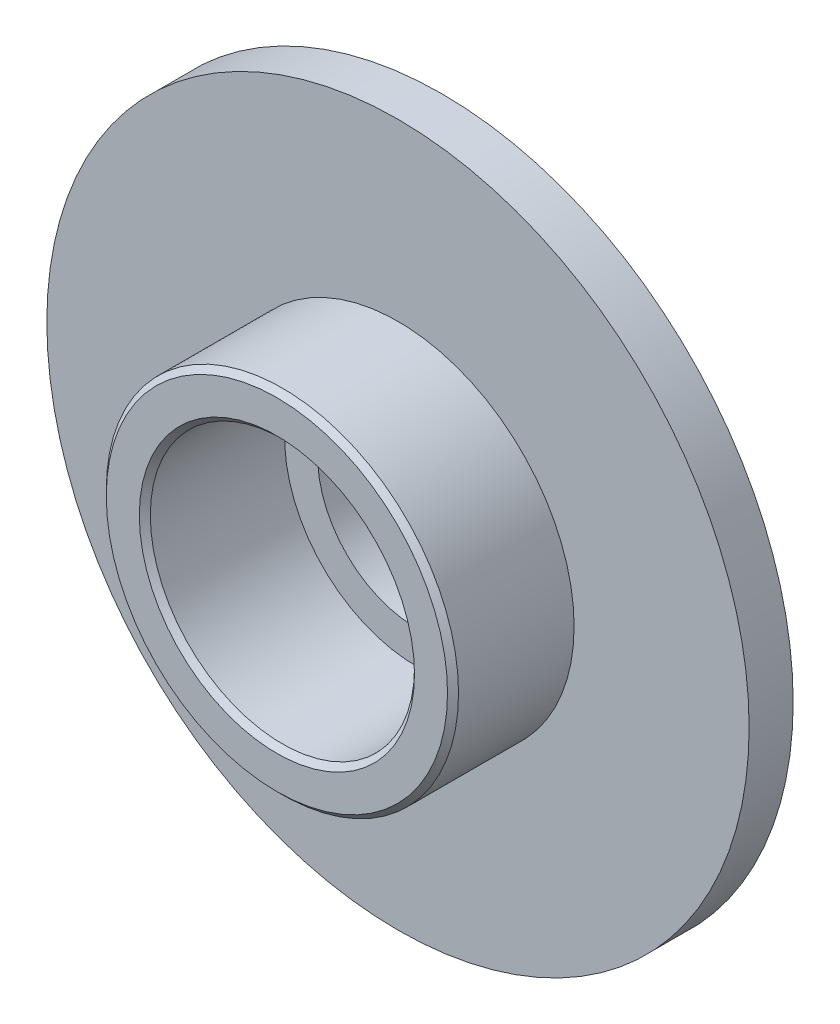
ISO-10303-21;
HEADER;
FILE_DESCRIPTION(('STEP AP214'),'2;1');
FILE_NAME('part.step','',(''),(''),'','','');
FILE_SCHEMA(('AUTOMOTIVE_DESIGN { 1 0 10303 214 1 1 1 1 }'));
ENDSEC;
DATA;
#1=APPLICATION_CONTEXT('core data for automotive mechanical design processes');
#2=APPLICATION_PROTOCOL_DEFINITION('international standard','automotive_design',2000,#1);
#3=PRODUCT_CONTEXT('',#1,'mechanical');
#4=PRODUCT('Part','Part','',(#3));
#5=PRODUCT_RELATED_PRODUCT_CATEGORY('part','',(#4));
#6=PRODUCT_DEFINITION_FORMATION('','',#4);
#7=PRODUCT_DEFINITION_CONTEXT('part definition',#1,'design');
#8=PRODUCT_DEFINITION('design','',#6,#7);
#9=PRODUCT_DEFINITION_SHAPE('','',#8);
#10=(LENGTH_UNIT() NAMED_UNIT(*) SI_UNIT(.MILLI.,.METRE.));
#11=(NAMED_UNIT(*) PLANE_ANGLE_UNIT() SI_UNIT($,.RADIAN.));
#12=(NAMED_UNIT(*) SI_UNIT($,.STERADIAN.) SOLID_ANGLE_UNIT());
#13=UNCERTAINTY_MEASURE_WITH_UNIT(LENGTH_MEASURE(1.E-05),#10,'distance_accuracy_value','');
#14=(GEOMETRIC_REPRESENTATION_CONTEXT(3) GLOBAL_UNCERTAINTY_ASSIGNED_CONTEXT((#13)) GLOBAL_UNIT_ASSIGNED_CONTEXT((#10,
#11,#12)) REPRESENTATION_CONTEXT('',''));
#15=CARTESIAN_POINT('',(0.,0.,0.));
#16=DIRECTION('',(0.,0.,1.));
#17=DIRECTION('',(1.,0.,0.));
#18=AXIS2_PLACEMENT_3D('',#15,#16,#17);
#19=CARTESIAN_POINT('',(0.,13.4,-5.5));
#20=DIRECTION('',(0.,0.,-1.));
#21=DIRECTION('',(-1.,0.,0.));
#22=AXIS2_PLACEMENT_3D('',#19,#20,#21);
#23=PLANE('',#22);
#24=CARTESIAN_POINT('',(0.,0.,-5.5));
#25=DIRECTION('',(0.,0.,1.));
#26=DIRECTION('',(1.,0.,0.));
#27=AXIS2_PLACEMENT_3D('',#24,#25,#26);
#28=CIRCLE('',#27,16.9);
#29=CARTESIAN_POINT('',(-8.80202735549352,14.4268608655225,-5.5));
#30=VERTEX_POINT('',#29);
#31=CARTESIAN_POINT('',(-2.76121314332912,-16.6729032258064,-5.5));
#32=VERTEX_POINT('',#31);
#33=EDGE_CURVE('E645',#30,#32,#28,.T.);
#34=ORIENTED_EDGE('',*,*,#33,.T.);
#35=CARTESIAN_POINT('',(-1.08235984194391E-13,-15.5,-5.5));
#36=DIRECTION('',(0.,0.,-1.));
#37=DIRECTION('',(-1.,0.,0.));
#38=AXIS2_PLACEMENT_3D('',#35,#36,#37);
#39=CIRCLE('',#38,3.);
#40=CARTESIAN_POINT('',(-1.98650596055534,-13.2519354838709,-5.50000000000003));
#41=VERTEX_POINT('',#40);
#42=EDGE_CURVE('E779',#32,#41,#39,.T.);
#43=ORIENTED_EDGE('',*,*,#42,.T.);
#44=CARTESIAN_POINT('',(0.,0.,-5.5));
#45=DIRECTION('',(0.,0.,1.));
#46=DIRECTION('',(1.,0.,0.));
#47=AXIS2_PLACEMENT_3D('',#44,#45,#46);
#48=CIRCLE('',#47,13.4);
#49=CARTESIAN_POINT('',(-2.10404371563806,13.2337825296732,-5.5));
#50=VERTEX_POINT('',#49);
#51=EDGE_CURVE('E641',#50,#41,#48,.T.);
#52=ORIENTED_EDGE('',*,*,#51,.F.);
#53=DIRECTION('',(-0.984503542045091,0.175364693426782,0.));
#54=VECTOR('',#53,1.);
#55=CARTESIAN_POINT('',(-0.0934021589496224,12.8756370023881,-5.5));
#56=LINE('',#55,#54);
#57=EDGE_CURVE('E732',#50,#30,#56,.T.);
#58=ORIENTED_EDGE('',*,*,#57,.T.);
#59=EDGE_LOOP('',(#34,#43,#52,#58));
#60=FACE_BOUND('',#59,.T.);
#61=ADVANCED_FACE('F353',(#60),#23,.F.);
#62=CARTESIAN_POINT('',(0.,0.,-5.));
#63=DIRECTION('',(0.,0.,1.));
#64=DIRECTION('',(1.,0.,0.));
#65=AXIS2_PLACEMENT_3D('',#62,#63,#64);
#66=TOROIDAL_SURFACE('',#65,13.4,0.5);
#67=ORIENTED_EDGE('',*,*,#51,.T.);
#68=CARTESIAN_POINT('',(-2.14262454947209,-13.4002,-5.47006198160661));
#69=CARTESIAN_POINT('',(-2.11391163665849,-13.3708529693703,-5.48218078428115));
#70=CARTESIAN_POINT('',(-2.08387957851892,-13.341458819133,-5.49039063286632));
#71=CARTESIAN_POINT('',(-2.02225090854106,-13.283647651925,-5.49977922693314));
#72=CARTESIAN_POINT('',(-1.99066828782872,-13.2552248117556,-5.50101218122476));
#73=CARTESIAN_POINT('',(-1.91969316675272,-13.194043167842,-5.49701045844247));
#74=CARTESIAN_POINT('',(-1.88007297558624,-13.1616543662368,-5.49033860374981));
#75=CARTESIAN_POINT('',(-1.80038846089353,-13.0997589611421,-5.4690941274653));
#76=CARTESIAN_POINT('',(-1.76032289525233,-13.0702687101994,-5.45447941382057));
#77=CARTESIAN_POINT('',(-1.68071326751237,-13.014523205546,-5.41768065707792));
#78=CARTESIAN_POINT('',(-1.64117959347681,-12.9883065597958,-5.39541613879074));
#79=CARTESIAN_POINT('',(-1.56485775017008,-12.940073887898,-5.34317044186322));
#80=CARTESIAN_POINT('',(-1.52805603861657,-12.9180361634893,-5.31323113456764));
#81=CARTESIAN_POINT('',(-1.47965975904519,-12.8902294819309,-5.26379116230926));
#82=CARTESIAN_POINT('',(-1.46556425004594,-12.8823000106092,-5.24794013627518));
#83=CARTESIAN_POINT('',(-1.43908802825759,-12.8676528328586,-5.21432957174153));
#84=CARTESIAN_POINT('',(-1.426706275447,-12.8609343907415,-5.1965712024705));
#85=CARTESIAN_POINT('',(-1.40612775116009,-12.8499206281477,-5.16187764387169));
#86=CARTESIAN_POINT('',(-1.3975815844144,-12.8454127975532,-5.14522085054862));
#87=CARTESIAN_POINT('',(-1.3829723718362,-12.8377723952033,-5.1105520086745));
#88=CARTESIAN_POINT('',(-1.376904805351,-12.83463731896,-5.092542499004));
#89=CARTESIAN_POINT('',(-1.36874552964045,-12.8304395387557,-5.0588718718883));
#90=CARTESIAN_POINT('',(-1.36613449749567,-12.8291052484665,-5.04337214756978));
#91=CARTESIAN_POINT('',(-1.36330580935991,-12.8276601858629,-5.01210094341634));
#92=CARTESIAN_POINT('',(-1.36308657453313,-12.8275486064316,-4.99632964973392));
#93=CARTESIAN_POINT('',(-1.36506333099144,-12.8285578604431,-4.96499763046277));
#94=CARTESIAN_POINT('',(-1.36725725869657,-12.8296776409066,-4.94943673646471));
#95=CARTESIAN_POINT('',(-1.37382633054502,-12.8330514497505,-4.91891107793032));
#96=CARTESIAN_POINT('',(-1.3782035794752,-12.8353065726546,-4.90394690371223));
#97=CARTESIAN_POINT('',(-1.39085160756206,-12.8418804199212,-4.86915326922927));
#98=CARTESIAN_POINT('',(-1.39997657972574,-12.8466619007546,-4.84972443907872));
#99=CARTESIAN_POINT('',(-1.4207436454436,-12.8577231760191,-4.81273082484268));
#100=CARTESIAN_POINT('',(-1.43239212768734,-12.8640067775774,-4.79517094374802));
#101=CARTESIAN_POINT('',(-1.46495428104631,-12.8819040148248,-4.75181590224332));
#102=CARTESIAN_POINT('',(-1.48722241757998,-12.8944483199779,-4.72743154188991));
#103=CARTESIAN_POINT('',(-1.53422520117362,-12.9218412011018,-4.68270367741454));
#104=CARTESIAN_POINT('',(-1.55896552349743,-12.9366951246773,-4.66236980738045));
#105=CARTESIAN_POINT('',(-1.62214093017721,-12.975990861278,-4.61637371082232));
#106=CARTESIAN_POINT('',(-1.66142732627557,-13.0016022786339,-4.59286978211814));
#107=CARTESIAN_POINT('',(-1.74120469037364,-13.0565260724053,-4.55336324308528));
#108=CARTESIAN_POINT('',(-1.78169742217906,-13.0858440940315,-4.53737225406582));
#109=CARTESIAN_POINT('',(-1.86313932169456,-13.1481129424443,-4.51322248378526));
#110=CARTESIAN_POINT('',(-1.90408762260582,-13.1811058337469,-4.50516762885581));
#111=CARTESIAN_POINT('',(-1.98451253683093,-13.2495628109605,-4.49843505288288));
#112=CARTESIAN_POINT('',(-2.02399525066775,-13.2850143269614,-4.49971268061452));
#113=CARTESIAN_POINT('',(-2.07586705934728,-13.3340943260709,-4.50881303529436));
#114=CARTESIAN_POINT('',(-2.08954989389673,-13.347295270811,-4.51196789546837));
#115=CARTESIAN_POINT('',(-2.11645522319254,-13.3737421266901,-4.51979494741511));
#116=CARTESIAN_POINT('',(-2.12967725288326,-13.3869880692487,-4.52446862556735));
#117=CARTESIAN_POINT('',(-2.14262454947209,-13.4002,-4.52993801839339));
#118=B_SPLINE_CURVE_WITH_KNOTS('',3,(#68,#69,#70,#71,#72,#73,#74,#75,#76,#77,#78,#79,#80,#81,
#82,#83,#84,#85,#86,#87,#88,#89,#90,#91,#92,#93,#94,#95,#96,#97,#98,#99,#100,#101,#102,#103,
#104,#105,#106,#107,#108,#109,#110,#111,#112,#113,#114,#115,#116,#117),.UNSPECIFIED.,.F.,.F.,(4,
2,2,2,2,2,2,2,2,2,2,2,2,2,2,2,2,2,2,2,2,2,2,2,4),(0.,0.127950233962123,0.254904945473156,
0.40896698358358,0.563853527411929,0.720422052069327,0.876153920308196,0.943963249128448,
1.01173124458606,1.06929936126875,1.12676200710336,1.17387310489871,1.22095310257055,
1.26799287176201,1.31507807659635,1.38067790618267,1.4464457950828,1.55182972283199,
1.65746138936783,1.81402616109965,1.97083232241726,2.12966565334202,2.287739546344,
2.345503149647,2.4033234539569),.UNSPECIFIED.);
#119=CARTESIAN_POINT('',(-1.98650596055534,-13.251935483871,-4.5));
#120=VERTEX_POINT('',#119);
#121=EDGE_CURVE('E777',#41,#120,#118,.T.);
#122=ORIENTED_EDGE('',*,*,#121,.T.);
#123=CARTESIAN_POINT('',(0.,0.,-4.5));
#124=DIRECTION('',(0.,0.,1.));
#125=DIRECTION('',(1.,0.,0.));
#126=AXIS2_PLACEMENT_3D('',#123,#124,#125);
#127=CIRCLE('',#126,13.4);
#128=CARTESIAN_POINT('',(-2.10404371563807,13.2337825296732,-4.5));
#129=VERTEX_POINT('',#128);
#130=EDGE_CURVE('E637',#129,#120,#127,.T.);
#131=ORIENTED_EDGE('',*,*,#130,.F.);
#132=CARTESIAN_POINT('',(-3.03831723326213,13.4002,-4.63370240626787));
#133=CARTESIAN_POINT('',(-3.00948138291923,13.3950636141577,-4.62314269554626));
#134=CARTESIAN_POINT('',(-2.98033948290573,13.3898727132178,-4.61349423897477));
#135=CARTESIAN_POINT('',(-2.92161312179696,13.3794120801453,-4.59578789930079));
#136=CARTESIAN_POINT('',(-2.89202902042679,13.3741424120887,-4.58772879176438));
#137=CARTESIAN_POINT('',(-2.83261577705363,13.3635594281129,-4.57297176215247));
#138=CARTESIAN_POINT('',(-2.80278741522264,13.3582462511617,-4.56627054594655));
#139=CARTESIAN_POINT('',(-2.74289387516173,13.3475777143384,-4.55404062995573));
#140=CARTESIAN_POINT('',(-2.71282864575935,13.3422223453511,-4.54851219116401));
#141=CARTESIAN_POINT('',(-2.62295010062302,13.3262127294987,-4.53357633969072));
#142=CARTESIAN_POINT('',(-2.5628909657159,13.3155146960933,-4.525684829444));
#143=CARTESIAN_POINT('',(-2.44241816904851,13.2940554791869,-4.51322421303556));
#144=CARTESIAN_POINT('',(-2.38200431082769,13.2832942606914,-4.50865716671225));
#145=CARTESIAN_POINT('',(-2.28892919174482,13.2667152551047,-4.50381349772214));
#146=CARTESIAN_POINT('',(-2.25631486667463,13.2609058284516,-4.50252957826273));
#147=CARTESIAN_POINT('',(-2.19107697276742,13.2492853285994,-4.50072821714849));
#148=CARTESIAN_POINT('',(-2.1584534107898,13.2434742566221,-4.5002105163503));
#149=CARTESIAN_POINT('',(-2.06024255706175,13.2259804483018,-4.4997358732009));
#150=CARTESIAN_POINT('',(-1.99464762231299,13.2142963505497,-4.50087371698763));
#151=CARTESIAN_POINT('',(-1.92910442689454,13.2026214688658,-4.503281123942));
#152=B_SPLINE_CURVE_WITH_KNOTS('',3,(#132,#133,#134,#135,#136,#137,#138,#139,#140,#141,#142,
#143,#144,#145,#146,#147,#148,#149,#150,#151),.UNSPECIFIED.,.F.,.F.,(4,2,2,2,2,2,2,2,2,4),(0.,
0.0933664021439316,0.186660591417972,0.279725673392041,0.372811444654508,0.557225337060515,
0.741753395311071,0.841202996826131,0.940618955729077,1.14046443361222),.UNSPECIFIED.);
#153=CARTESIAN_POINT('',(-1.9293044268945,13.2026570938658,-4.50327374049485));
#154=VERTEX_POINT('',#153);
#155=EDGE_CURVE('E719',#129,#154,#152,.T.);
#156=ORIENTED_EDGE('',*,*,#155,.T.);
#157=CARTESIAN_POINT('',(-1.9295044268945,13.2028250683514,-4.50325133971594));
#158=CARTESIAN_POINT('',(-1.90954511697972,13.1860587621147,-4.50548914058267));
#159=CARTESIAN_POINT('',(-1.88945634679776,13.1696310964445,-4.50883491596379));
#160=CARTESIAN_POINT('',(-1.8491473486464,13.1375187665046,-4.51762700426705));
#161=CARTESIAN_POINT('',(-1.82892713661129,13.121834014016,-4.52307306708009));
#162=CARTESIAN_POINT('',(-1.76792756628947,13.0757406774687,-4.54249352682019));
#163=CARTESIAN_POINT('',(-1.72713471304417,13.0465651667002,-4.5595107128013));
#164=CARTESIAN_POINT('',(-1.65349638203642,12.9964809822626,-4.59781072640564));
#165=CARTESIAN_POINT('',(-1.62043519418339,12.9749990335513,-4.61795370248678));
#166=CARTESIAN_POINT('',(-1.55650284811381,12.9351026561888,-4.66386550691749));
#167=CARTESIAN_POINT('',(-1.5256238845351,12.9166769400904,-4.68961278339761));
#168=CARTESIAN_POINT('',(-1.4814556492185,12.891242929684,-4.73420646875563));
#169=CARTESIAN_POINT('',(-1.4666219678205,12.8828880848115,-4.75075923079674));
#170=CARTESIAN_POINT('',(-1.4388322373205,12.8675085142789,-4.78595417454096));
#171=CARTESIAN_POINT('',(-1.42587427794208,12.8604824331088,-4.80459419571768));
#172=CARTESIAN_POINT('',(-1.40510257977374,12.8493780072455,-4.84006395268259));
#173=CARTESIAN_POINT('',(-1.39677854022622,12.8449908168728,-4.85649346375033));
#174=CARTESIAN_POINT('',(-1.38254998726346,12.8375536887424,-4.89065749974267));
#175=CARTESIAN_POINT('',(-1.37664133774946,12.8345014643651,-4.90838973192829));
#176=CARTESIAN_POINT('',(-1.36862339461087,12.830376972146,-4.94176634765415));
#177=CARTESIAN_POINT('',(-1.36604498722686,12.8290594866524,-4.95726610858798));
#178=CARTESIAN_POINT('',(-1.36328164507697,12.8276478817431,-4.98853109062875));
#179=CARTESIAN_POINT('',(-1.36309516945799,12.8275529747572,-5.00429613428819));
#180=CARTESIAN_POINT('',(-1.36513369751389,12.8285938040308,-5.03560844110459));
#181=CARTESIAN_POINT('',(-1.36735644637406,12.8297283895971,-5.05115589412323));
#182=CARTESIAN_POINT('',(-1.37397689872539,12.8331289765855,-5.08165128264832));
#183=CARTESIAN_POINT('',(-1.37837673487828,12.8353960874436,-5.09659861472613));
#184=CARTESIAN_POINT('',(-1.39109048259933,12.8420052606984,-5.13140408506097));
#185=CARTESIAN_POINT('',(-1.40026478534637,12.8468137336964,-5.15085668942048));
#186=CARTESIAN_POINT('',(-1.42113036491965,12.857930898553,-5.18788767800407));
#187=CARTESIAN_POINT('',(-1.43282779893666,12.8642432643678,-5.20546131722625));
#188=CARTESIAN_POINT('',(-1.46552221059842,12.8822210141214,-5.24885352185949));
#189=CARTESIAN_POINT('',(-1.48787405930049,12.8948192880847,-5.27325529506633));
#190=CARTESIAN_POINT('',(-1.53505580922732,12.922334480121,-5.31801792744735));
#191=CARTESIAN_POINT('',(-1.55989277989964,12.9372580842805,-5.33836673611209));
#192=CARTESIAN_POINT('',(-1.62328072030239,12.9767208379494,-5.3843616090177));
#193=CARTESIAN_POINT('',(-1.66267817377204,13.0024306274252,-5.40784262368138));
#194=CARTESIAN_POINT('',(-1.74257067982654,13.0575005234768,-5.44721758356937));
#195=CARTESIAN_POINT('',(-1.78306412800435,13.0868554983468,-5.46312204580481));
#196=CARTESIAN_POINT('',(-1.84125575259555,13.1313967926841,-5.4802471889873));
#197=CARTESIAN_POINT('',(-1.85901729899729,13.1453091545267,-5.48470269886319));
#198=CARTESIAN_POINT('',(-1.89438793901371,13.1736707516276,-5.49197146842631));
#199=CARTESIAN_POINT('',(-1.91199726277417,13.1881188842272,-5.49478792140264));
#200=CARTESIAN_POINT('',(-1.9295044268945,13.2028250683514,-5.49674866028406));
#201=B_SPLINE_CURVE_WITH_KNOTS('',3,(#157,#158,#159,#160,#161,#162,#163,#164,#165,#166,#167,
#168,#169,#170,#171,#172,#173,#174,#175,#176,#177,#178,#179,#180,#181,#182,#183,#184,#185,#186,
#187,#188,#189,#190,#191,#192,#193,#194,#195,#196,#197,#198,#199,#200),.UNSPECIFIED.,.F.,.F.,(4,
2,2,2,2,2,2,2,2,2,2,2,2,2,2,2,2,2,2,2,2,4),(0.,0.0784204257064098,0.15683151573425,
0.314916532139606,0.447355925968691,0.579294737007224,0.650385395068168,0.721403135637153,
0.778009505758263,0.834518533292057,0.88160886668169,0.928668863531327,0.975684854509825,
1.02274699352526,1.08848799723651,1.15439128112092,1.26002686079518,1.36597198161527,
1.52291459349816,1.6796387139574,1.74857484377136,1.81737621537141),.UNSPECIFIED.);
#202=CARTESIAN_POINT('',(-1.9293044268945,13.2026570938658,-5.49672625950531));
#203=VERTEX_POINT('',#202);
#204=EDGE_CURVE('E610',#154,#203,#201,.T.);
#205=ORIENTED_EDGE('',*,*,#204,.T.);
#206=CARTESIAN_POINT('',(-1.92910442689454,13.2026214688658,-5.496718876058));
#207=CARTESIAN_POINT('',(-1.9708567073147,13.2100585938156,-5.4982585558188));
#208=CARTESIAN_POINT('',(-2.01262739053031,13.2174989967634,-5.49927621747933));
#209=CARTESIAN_POINT('',(-2.09619132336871,13.2323838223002,-5.50018307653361));
#210=CARTESIAN_POINT('',(-2.13798457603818,13.239828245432,-5.50007197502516));
#211=CARTESIAN_POINT('',(-2.26386966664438,13.2622515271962,-5.4979089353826));
#212=CARTESIAN_POINT('',(-2.3479404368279,13.2772266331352,-5.49400564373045));
#213=CARTESIAN_POINT('',(-2.51383016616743,13.3067757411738,-5.48037303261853));
#214=CARTESIAN_POINT('',(-2.59565835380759,13.3213513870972,-5.47077218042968));
#215=CARTESIAN_POINT('',(-2.71741519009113,13.3430393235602,-5.45080871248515));
#216=CARTESIAN_POINT('',(-2.75778983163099,13.3502310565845,-5.44323930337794));
#217=CARTESIAN_POINT('',(-2.83807612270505,13.364532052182,-5.42591171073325));
#218=CARTESIAN_POINT('',(-2.87798796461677,13.3716413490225,-5.41615447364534));
#219=CARTESIAN_POINT('',(-2.93787023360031,13.3823078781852,-5.39938017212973));
#220=CARTESIAN_POINT('',(-2.95810562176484,13.385912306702,-5.39333584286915));
#221=CARTESIAN_POINT('',(-2.99838383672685,13.3930868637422,-5.38044204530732));
#222=CARTESIAN_POINT('',(-3.01842602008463,13.3966568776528,-5.37359050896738));
#223=CARTESIAN_POINT('',(-3.03831723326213,13.4002,-5.36629759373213));
#224=B_SPLINE_CURVE_WITH_KNOTS('',3,(#206,#207,#208,#209,#210,#211,#212,#213,#214,#215,#216,
#217,#218,#219,#220,#221,#222,#223),.UNSPECIFIED.,.F.,.F.,(4,2,2,2,2,2,2,2,4),(0.,
0.127307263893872,0.254648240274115,0.510933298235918,0.761648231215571,0.88671297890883,
1.01172372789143,1.07598224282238,1.1404091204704),.UNSPECIFIED.);
#225=EDGE_CURVE('E726',#203,#50,#224,.T.);
#226=ORIENTED_EDGE('',*,*,#225,.T.);
#227=EDGE_LOOP('',(#67,#122,#131,#156,#205,#226));
#228=FACE_BOUND('',#227,.T.);
#229=ADVANCED_FACE('F669',(#228),#66,.F.);
#230=CARTESIAN_POINT('',(0.,16.9,-4.5));
#231=DIRECTION('',(0.,0.,1.));
#232=DIRECTION('',(1.,0.,0.));
#233=AXIS2_PLACEMENT_3D('',#230,#231,#232);
#234=PLANE('',#233);
#235=ORIENTED_EDGE('',*,*,#130,.T.);
#236=CARTESIAN_POINT('',(-1.08235984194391E-13,-15.5,-4.5));
#237=DIRECTION('',(0.,0.,1.));
#238=DIRECTION('',(1.,0.,0.));
#239=AXIS2_PLACEMENT_3D('',#236,#237,#238);
#240=CIRCLE('',#239,3.);
#241=CARTESIAN_POINT('',(-2.76121314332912,-16.6729032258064,-4.5));
#242=VERTEX_POINT('',#241);
#243=EDGE_CURVE('E776',#120,#242,#240,.T.);
#244=ORIENTED_EDGE('',*,*,#243,.T.);
#245=CARTESIAN_POINT('',(0.,0.,-4.5));
#246=DIRECTION('',(0.,0.,1.));
#247=DIRECTION('',(1.,0.,0.));
#248=AXIS2_PLACEMENT_3D('',#245,#246,#247);
#249=CIRCLE('',#248,16.9);
#250=CARTESIAN_POINT('',(-8.80202735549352,14.4268608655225,-4.5));
#251=VERTEX_POINT('',#250);
#252=EDGE_CURVE('E510',#251,#242,#249,.T.);
#253=ORIENTED_EDGE('',*,*,#252,.F.);
#254=DIRECTION('',(0.984503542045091,-0.175364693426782,0.));
#255=VECTOR('',#254,1.);
#256=CARTESIAN_POINT('',(-0.697667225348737,12.9832717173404,-4.5));
#257=LINE('',#256,#255);
#258=EDGE_CURVE('E716',#251,#129,#257,.T.);
#259=ORIENTED_EDGE('',*,*,#258,.T.);
#260=EDGE_LOOP('',(#235,#244,#253,#259));
#261=FACE_BOUND('',#260,.T.);
#262=ADVANCED_FACE('F545',(#261),#234,.F.);
#263=CARTESIAN_POINT('',(0.,0.,13.7955271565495));
#264=DIRECTION('',(0.,0.,1.));
#265=DIRECTION('',(1.,0.,0.));
#266=AXIS2_PLACEMENT_3D('',#263,#264,#265);
#267=CYLINDRICAL_SURFACE('',#266,12.);
#268=CARTESIAN_POINT('',(0.,0.,14.5));
#269=DIRECTION('',(0.,0.,-1.));
#270=DIRECTION('',(-1.,0.,0.));
#271=AXIS2_PLACEMENT_3D('',#268,#269,#270);
#272=CIRCLE('',#271,12.);
#273=CARTESIAN_POINT('',(-12.,0.,14.5));
#274=VERTEX_POINT('',#273);
#275=EDGE_CURVE('E523',#274,#274,#272,.F.);
#276=ORIENTED_EDGE('',*,*,#275,.T.);
#277=EDGE_LOOP('',(#276));
#278=FACE_BOUND('',#277,.T.);
#279=CARTESIAN_POINT('',(0.,0.,2.3));
#280=DIRECTION('',(0.,0.,1.));
#281=DIRECTION('',(1.,0.,0.));
#282=AXIS2_PLACEMENT_3D('',#279,#280,#281);
#283=CIRCLE('',#282,12.);
#284=CARTESIAN_POINT('',(12.,0.,2.3));
#285=VERTEX_POINT('',#284);
#286=EDGE_CURVE('E548',#285,#285,#283,.T.);
#287=ORIENTED_EDGE('',*,*,#286,.F.);
#288=EDGE_LOOP('',(#287));
#289=FACE_BOUND('',#288,.T.);
#290=ADVANCED_FACE('F355',(#278,#289),#267,.F.);
#291=CARTESIAN_POINT('',(0.,9.,2.3));
#292=DIRECTION('',(0.,0.,-1.));
#293=DIRECTION('',(-1.,0.,0.));
#294=AXIS2_PLACEMENT_3D('',#291,#292,#293);
#295=PLANE('',#294);
#296=CARTESIAN_POINT('',(0.,0.,2.3));
#297=DIRECTION('',(0.,0.,1.));
#298=DIRECTION('',(1.,0.,0.));
#299=AXIS2_PLACEMENT_3D('',#296,#297,#298);
#300=CIRCLE('',#299,9.);
#301=CARTESIAN_POINT('',(9.,0.,2.3));
#302=VERTEX_POINT('',#301);
#303=EDGE_CURVE('E551',#302,#302,#300,.T.);
#304=ORIENTED_EDGE('',*,*,#303,.F.);
#305=EDGE_LOOP('',(#304));
#306=FACE_BOUND('',#305,.T.);
#307=ORIENTED_EDGE('',*,*,#286,.T.);
#308=EDGE_LOOP('',(#307));
#309=FACE_BOUND('',#308,.T.);
#310=ADVANCED_FACE('F544',(#306,#309),#295,.F.);
#311=CARTESIAN_POINT('',(0.,0.,13.7955271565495));
#312=DIRECTION('',(0.,0.,1.));
#313=DIRECTION('',(1.,0.,0.));
#314=AXIS2_PLACEMENT_3D('',#311,#312,#313);
#315=CYLINDRICAL_SURFACE('',#314,9.);
#316=CARTESIAN_POINT('',(0.,0.,-7.7));
#317=DIRECTION('',(0.,0.,1.));
#318=DIRECTION('',(1.,0.,0.));
#319=AXIS2_PLACEMENT_3D('',#316,#317,#318);
#320=CIRCLE('',#319,9.);
#321=CARTESIAN_POINT('',(9.,0.,-7.7));
#322=VERTEX_POINT('',#321);
#323=EDGE_CURVE('E555',#322,#322,#320,.T.);
#324=ORIENTED_EDGE('',*,*,#323,.F.);
#325=EDGE_LOOP('',(#324));
#326=FACE_BOUND('',#325,.T.);
#327=ORIENTED_EDGE('',*,*,#303,.T.);
#328=EDGE_LOOP('',(#327));
#329=FACE_BOUND('',#328,.T.);
#330=ADVANCED_FACE('F659',(#326,#329),#315,.F.);
#331=CARTESIAN_POINT('',(0.,14.45,-7.7));
#332=DIRECTION('',(0.,0.,1.));
#333=DIRECTION('',(1.,0.,0.));
#334=AXIS2_PLACEMENT_3D('',#331,#332,#333);
#335=PLANE('',#334);
#336=DIRECTION('',(-0.98450354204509,0.175364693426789,0.));
#337=VECTOR('',#336,1.);
#338=CARTESIAN_POINT('',(-4.71482129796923,-12.0191721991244,-7.7));
#339=LINE('',#338,#337);
#340=CARTESIAN_POINT('',(4.63858674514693,-13.6852480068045,-7.7));
#341=VERTEX_POINT('',#340);
#342=CARTESIAN_POINT('',(1.92930442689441,-13.2026570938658,-7.7));
#343=VERTEX_POINT('',#342);
#344=EDGE_CURVE('E749',#341,#343,#339,.T.);
#345=ORIENTED_EDGE('',*,*,#344,.T.);
#346=CARTESIAN_POINT('',(-1.08235984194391E-13,-15.5,-7.7));
#347=DIRECTION('',(0.,0.,1.));
#348=DIRECTION('',(1.,0.,0.));
#349=AXIS2_PLACEMENT_3D('',#346,#347,#348);
#350=CIRCLE('',#349,3.);
#351=CARTESIAN_POINT('',(-2.70140822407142,-14.1952419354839,-7.7));
#352=VERTEX_POINT('',#351);
#353=EDGE_CURVE('E747',#343,#352,#350,.T.);
#354=ORIENTED_EDGE('',*,*,#353,.T.);
#355=CARTESIAN_POINT('',(0.,0.,-7.7));
#356=DIRECTION('',(0.,0.,1.));
#357=DIRECTION('',(1.,0.,0.));
#358=AXIS2_PLACEMENT_3D('',#355,#356,#357);
#359=CIRCLE('',#358,14.45);
#360=CARTESIAN_POINT('',(-4.63858674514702,13.6852480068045,-7.7));
#361=VERTEX_POINT('',#360);
#362=EDGE_CURVE('E652',#361,#352,#359,.T.);
#363=ORIENTED_EDGE('',*,*,#362,.F.);
#364=DIRECTION('',(0.984503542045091,-0.175364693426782,0.));
#365=VECTOR('',#364,1.);
#366=CARTESIAN_POINT('',(-0.274681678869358,12.9079274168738,-7.7));
#367=LINE('',#366,#365);
#368=CARTESIAN_POINT('',(-1.9293044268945,13.2026570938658,-7.7));
#369=VERTEX_POINT('',#368);
#370=EDGE_CURVE('E581',#361,#369,#367,.T.);
#371=ORIENTED_EDGE('',*,*,#370,.T.);
#372=CARTESIAN_POINT('',(0.,15.5,-7.7));
#373=DIRECTION('',(0.,0.,1.));
#374=DIRECTION('',(1.,0.,0.));
#375=AXIS2_PLACEMENT_3D('',#372,#373,#374);
#376=CIRCLE('',#375,3.);
#377=CARTESIAN_POINT('',(2.70140822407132,14.1952419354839,-7.7));
#378=VERTEX_POINT('',#377);
#379=EDGE_CURVE('E619',#369,#378,#376,.T.);
#380=ORIENTED_EDGE('',*,*,#379,.T.);
#381=EDGE_CURVE('E651',#341,#378,#359,.T.);
#382=ORIENTED_EDGE('',*,*,#381,.F.);
#383=EDGE_LOOP('',(#345,#354,#363,#371,#380,#382));
#384=FACE_BOUND('',#383,.T.);
#385=ORIENTED_EDGE('',*,*,#323,.T.);
#386=EDGE_LOOP('',(#385));
#387=FACE_BOUND('',#386,.T.);
#388=ADVANCED_FACE('F657',(#384,#387),#335,.F.);
#389=CARTESIAN_POINT('',(0.,0.,13.7955271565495));
#390=DIRECTION('',(0.,0.,1.));
#391=DIRECTION('',(1.,0.,0.));
#392=AXIS2_PLACEMENT_3D('',#389,#390,#391);
#393=CYLINDRICAL_SURFACE('',#392,14.45);
#394=ORIENTED_EDGE('',*,*,#362,.T.);
#395=DIRECTION('',(0.,0.,1.));
#396=VECTOR('',#395,1.);
#397=CARTESIAN_POINT('',(-2.70140822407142,-14.1952419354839,-5.));
#398=LINE('',#397,#396);
#399=CARTESIAN_POINT('',(-2.70140822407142,-14.1952419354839,-8.4));
#400=VERTEX_POINT('',#399);
#401=EDGE_CURVE('E752',#352,#400,#398,.F.);
#402=ORIENTED_EDGE('',*,*,#401,.T.);
#403=CARTESIAN_POINT('',(0.,0.,-8.4));
#404=DIRECTION('',(0.,0.,1.));
#405=DIRECTION('',(1.,0.,0.));
#406=AXIS2_PLACEMENT_3D('',#403,#404,#405);
#407=CIRCLE('',#406,14.45);
#408=CARTESIAN_POINT('',(4.63858674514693,-13.6852480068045,-8.4));
#409=VERTEX_POINT('',#408);
#410=EDGE_CURVE('E751',#409,#400,#407,.F.);
#411=ORIENTED_EDGE('',*,*,#410,.F.);
#412=DIRECTION('',(0.,0.,1.));
#413=VECTOR('',#412,1.);
#414=CARTESIAN_POINT('',(4.63858674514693,-13.6852480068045,13.7955271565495));
#415=LINE('',#414,#413);
#416=EDGE_CURVE('E781',#409,#341,#415,.T.);
#417=ORIENTED_EDGE('',*,*,#416,.T.);
#418=ORIENTED_EDGE('',*,*,#381,.T.);
#419=DIRECTION('',(0.,0.,1.));
#420=VECTOR('',#419,1.);
#421=CARTESIAN_POINT('',(2.70140822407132,14.1952419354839,-5.));
#422=LINE('',#421,#420);
#423=CARTESIAN_POINT('',(2.70140822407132,14.1952419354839,-8.4));
#424=VERTEX_POINT('',#423);
#425=EDGE_CURVE('E616',#378,#424,#422,.F.);
#426=ORIENTED_EDGE('',*,*,#425,.T.);
#427=CARTESIAN_POINT('',(0.,0.,-8.4));
#428=DIRECTION('',(0.,0.,1.));
#429=DIRECTION('',(1.,0.,0.));
#430=AXIS2_PLACEMENT_3D('',#427,#428,#429);
#431=CIRCLE('',#430,14.45);
#432=CARTESIAN_POINT('',(-4.63858674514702,13.6852480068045,-8.4));
#433=VERTEX_POINT('',#432);
#434=EDGE_CURVE('E622',#433,#424,#431,.F.);
#435=ORIENTED_EDGE('',*,*,#434,.F.);
#436=DIRECTION('',(0.,0.,1.));
#437=VECTOR('',#436,1.);
#438=CARTESIAN_POINT('',(-4.63858674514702,13.6852480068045,13.7955271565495));
#439=LINE('',#438,#437);
#440=EDGE_CURVE('E586',#433,#361,#439,.T.);
#441=ORIENTED_EDGE('',*,*,#440,.T.);
#442=EDGE_LOOP('',(#394,#402,#411,#417,#418,#426,#435,#441));
#443=FACE_BOUND('',#442,.T.);
#444=CARTESIAN_POINT('',(0.,0.,-9.));
#445=DIRECTION('',(0.,0.,1.));
#446=DIRECTION('',(1.,0.,0.));
#447=AXIS2_PLACEMENT_3D('',#444,#445,#446);
#448=CIRCLE('',#447,14.45);
#449=CARTESIAN_POINT('',(14.45,0.,-9.));
#450=VERTEX_POINT('',#449);
#451=EDGE_CURVE('E648',#450,#450,#448,.T.);
#452=ORIENTED_EDGE('',*,*,#451,.F.);
#453=EDGE_LOOP('',(#452));
#454=FACE_BOUND('',#453,.T.);
#455=ADVANCED_FACE('F739',(#443,#454),#393,.F.);
#456=CARTESIAN_POINT('',(0.,14.45,-9.));
#457=DIRECTION('',(0.,0.,1.));
#458=DIRECTION('',(1.,0.,0.));
#459=AXIS2_PLACEMENT_3D('',#456,#457,#458);
#460=PLANE('',#459);
#461=CARTESIAN_POINT('',(0.,0.,-9.));
#462=DIRECTION('',(0.,0.,1.));
#463=DIRECTION('',(1.,0.,0.));
#464=AXIS2_PLACEMENT_3D('',#461,#462,#463);
#465=CIRCLE('',#464,16.7);
#466=CARTESIAN_POINT('',(16.7,0.,-9.));
#467=VERTEX_POINT('',#466);
#468=EDGE_CURVE('E515',#467,#467,#465,.F.);
#469=ORIENTED_EDGE('',*,*,#468,.T.);
#470=EDGE_LOOP('',(#469));
#471=FACE_BOUND('',#470,.T.);
#472=ORIENTED_EDGE('',*,*,#451,.T.);
#473=EDGE_LOOP('',(#472));
#474=FACE_BOUND('',#473,.T.);
#475=ADVANCED_FACE('F687',(#471,#474),#460,.F.);
#476=CARTESIAN_POINT('',(0.,0.,13.7955271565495));
#477=DIRECTION('',(0.,0.,1.));
#478=DIRECTION('',(1.,0.,0.));
#479=AXIS2_PLACEMENT_3D('',#476,#477,#478);
#480=CYLINDRICAL_SURFACE('',#479,16.9);
#481=CARTESIAN_POINT('',(0.,0.,-8.8));
#482=DIRECTION('',(0.,0.,1.));
#483=DIRECTION('',(1.,0.,0.));
#484=AXIS2_PLACEMENT_3D('',#481,#482,#483);
#485=CIRCLE('',#484,16.9);
#486=CARTESIAN_POINT('',(16.9,0.,-8.8));
#487=VERTEX_POINT('',#486);
#488=EDGE_CURVE('E511',#487,#487,#485,.T.);
#489=ORIENTED_EDGE('',*,*,#488,.T.);
#490=EDGE_LOOP('',(#489));
#491=FACE_BOUND('',#490,.T.);
#492=CARTESIAN_POINT('',(0.,0.,-8.4));
#493=DIRECTION('',(0.,0.,1.));
#494=DIRECTION('',(-1.,0.,0.));
#495=AXIS2_PLACEMENT_3D('',#492,#493,#494);
#496=CIRCLE('',#495,16.9);
#497=CARTESIAN_POINT('',(-2.76121314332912,-16.6729032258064,-8.4));
#498=VERTEX_POINT('',#497);
#499=CARTESIAN_POINT('',(8.80202735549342,-14.4268608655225,-8.4));
#500=VERTEX_POINT('',#499);
#501=EDGE_CURVE('E809',#498,#500,#496,.T.);
#502=ORIENTED_EDGE('',*,*,#501,.F.);
#503=DIRECTION('',(0.,0.,1.));
#504=VECTOR('',#503,1.);
#505=CARTESIAN_POINT('',(-2.76121314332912,-16.6729032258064,-8.4));
#506=LINE('',#505,#504);
#507=EDGE_CURVE('E808',#498,#32,#506,.T.);
#508=ORIENTED_EDGE('',*,*,#507,.T.);
#509=ORIENTED_EDGE('',*,*,#33,.F.);
#510=DIRECTION('',(0.,0.,1.));
#511=VECTOR('',#510,1.);
#512=CARTESIAN_POINT('',(-8.80202735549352,14.4268608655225,-8.4));
#513=LINE('',#512,#511);
#514=CARTESIAN_POINT('',(-8.80202735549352,14.4268608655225,-8.4));
#515=VERTEX_POINT('',#514);
#516=EDGE_CURVE('E708',#515,#30,#513,.T.);
#517=ORIENTED_EDGE('',*,*,#516,.F.);
#518=CARTESIAN_POINT('',(0.,0.,-8.4));
#519=DIRECTION('',(0.,0.,1.));
#520=DIRECTION('',(1.,0.,0.));
#521=AXIS2_PLACEMENT_3D('',#518,#519,#520);
#522=CIRCLE('',#521,16.9);
#523=CARTESIAN_POINT('',(2.761213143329,16.6729032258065,-8.4));
#524=VERTEX_POINT('',#523);
#525=EDGE_CURVE('E707',#524,#515,#522,.T.);
#526=ORIENTED_EDGE('',*,*,#525,.F.);
#527=DIRECTION('',(0.,0.,1.));
#528=VECTOR('',#527,1.);
#529=CARTESIAN_POINT('',(2.761213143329,16.6729032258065,-8.4));
#530=LINE('',#529,#528);
#531=CARTESIAN_POINT('',(2.761213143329,16.6729032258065,-5.5));
#532=VERTEX_POINT('',#531);
#533=EDGE_CURVE('E701',#524,#532,#530,.T.);
#534=ORIENTED_EDGE('',*,*,#533,.T.);
#535=CARTESIAN_POINT('',(8.80202735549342,-14.4268608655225,-5.5));
#536=VERTEX_POINT('',#535);
#537=EDGE_CURVE('E644',#536,#532,#28,.T.);
#538=ORIENTED_EDGE('',*,*,#537,.F.);
#539=DIRECTION('',(0.,0.,1.));
#540=VECTOR('',#539,1.);
#541=CARTESIAN_POINT('',(8.80202735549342,-14.4268608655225,-8.4));
#542=LINE('',#541,#540);
#543=EDGE_CURVE('E810',#500,#536,#542,.T.);
#544=ORIENTED_EDGE('',*,*,#543,.F.);
#545=EDGE_LOOP('',(#502,#508,#509,#517,#526,#534,#538,#544));
#546=FACE_BOUND('',#545,.T.);
#547=ADVANCED_FACE('F679',(#491,#546),#480,.T.);
#548=CARTESIAN_POINT('',(2.10404371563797,-13.2337825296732,-5.5));
#549=VERTEX_POINT('',#548);
#550=CARTESIAN_POINT('',(1.98650596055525,13.251935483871,-5.50000000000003));
#551=VERTEX_POINT('',#550);
#552=EDGE_CURVE('E640',#549,#551,#48,.T.);
#553=ORIENTED_EDGE('',*,*,#552,.F.);
#554=DIRECTION('',(0.98450354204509,-0.175364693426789,0.));
#555=VECTOR('',#554,1.);
#556=CARTESIAN_POINT('',(-4.53354177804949,-12.0514626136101,-5.5));
#557=LINE('',#556,#555);
#558=EDGE_CURVE('E692',#549,#536,#557,.T.);
#559=ORIENTED_EDGE('',*,*,#558,.T.);
#560=ORIENTED_EDGE('',*,*,#537,.T.);
#561=CARTESIAN_POINT('',(0.,15.5,-5.5));
#562=DIRECTION('',(0.,0.,-1.));
#563=DIRECTION('',(-1.,0.,0.));
#564=AXIS2_PLACEMENT_3D('',#561,#562,#563);
#565=CIRCLE('',#564,3.);
#566=EDGE_CURVE('E583',#532,#551,#565,.T.);
#567=ORIENTED_EDGE('',*,*,#566,.T.);
#568=EDGE_LOOP('',(#553,#559,#560,#567));
#569=FACE_BOUND('',#568,.T.);
#570=ADVANCED_FACE('F671',(#569),#23,.F.);
#571=CARTESIAN_POINT('',(2.10404371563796,-13.2337825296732,-4.5));
#572=VERTEX_POINT('',#571);
#573=CARTESIAN_POINT('',(1.98650596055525,13.251935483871,-4.5));
#574=VERTEX_POINT('',#573);
#575=EDGE_CURVE('E579',#572,#574,#127,.T.);
#576=ORIENTED_EDGE('',*,*,#575,.F.);
#577=CARTESIAN_POINT('',(3.03831723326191,-13.4002,-4.63370240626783));
#578=CARTESIAN_POINT('',(3.00948138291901,-13.3950636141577,-4.62314269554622));
#579=CARTESIAN_POINT('',(2.9803394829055,-13.3898727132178,-4.61349423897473));
#580=CARTESIAN_POINT('',(2.92161312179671,-13.3794120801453,-4.59578789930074));
#581=CARTESIAN_POINT('',(2.89202902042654,-13.3741424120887,-4.58772879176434));
#582=CARTESIAN_POINT('',(2.83261577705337,-13.3635594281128,-4.57297176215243));
#583=CARTESIAN_POINT('',(2.80278741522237,-13.3582462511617,-4.56627054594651));
#584=CARTESIAN_POINT('',(2.74289387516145,-13.3475777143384,-4.55404062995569));
#585=CARTESIAN_POINT('',(2.71282864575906,-13.3422223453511,-4.54851219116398));
#586=CARTESIAN_POINT('',(2.6229501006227,-13.3262127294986,-4.53357633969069));
#587=CARTESIAN_POINT('',(2.56289096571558,-13.3155146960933,-4.52568482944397));
#588=CARTESIAN_POINT('',(2.44241816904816,-13.2940554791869,-4.51322421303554));
#589=CARTESIAN_POINT('',(2.38200431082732,-13.2832942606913,-4.50865716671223));
#590=CARTESIAN_POINT('',(2.28892919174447,-13.2667152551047,-4.50381349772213));
#591=CARTESIAN_POINT('',(2.2563148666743,-13.2609058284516,-4.50252957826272));
#592=CARTESIAN_POINT('',(2.19107697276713,-13.2492853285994,-4.50072821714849));
#593=CARTESIAN_POINT('',(2.15845341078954,-13.2434742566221,-4.5002105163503));
#594=CARTESIAN_POINT('',(2.06024255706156,-13.2259804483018,-4.49973587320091));
#595=CARTESIAN_POINT('',(1.99464762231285,-13.2142963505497,-4.50087371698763));
#596=CARTESIAN_POINT('',(1.92910442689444,-13.2026214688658,-4.503281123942));
#597=B_SPLINE_CURVE_WITH_KNOTS('',3,(#577,#578,#579,#580,#581,#582,#583,#584,#585,#586,#587,
#588,#589,#590,#591,#592,#593,#594,#595,#596),.UNSPECIFIED.,.F.,.F.,(4,2,2,2,2,2,2,2,2,4),(0.,
0.0933664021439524,0.186660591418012,0.279725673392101,0.372811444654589,0.557225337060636,
0.741753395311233,0.84120299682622,0.940618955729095,1.14046443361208),.UNSPECIFIED.);
#598=CARTESIAN_POINT('',(1.92930442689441,-13.2026570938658,-4.50327374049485));
#599=VERTEX_POINT('',#598);
#600=EDGE_CURVE('E818',#572,#599,#597,.T.);
#601=ORIENTED_EDGE('',*,*,#600,.T.);
#602=CARTESIAN_POINT('',(1.92950442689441,-13.2028250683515,-4.50325133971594));
#603=CARTESIAN_POINT('',(1.90954511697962,-13.1860587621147,-4.50548914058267));
#604=CARTESIAN_POINT('',(1.88945634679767,-13.1696310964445,-4.50883491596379));
#605=CARTESIAN_POINT('',(1.84914734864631,-13.1375187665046,-4.51762700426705));
#606=CARTESIAN_POINT('',(1.8289271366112,-13.121834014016,-4.52307306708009));
#607=CARTESIAN_POINT('',(1.76792756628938,-13.0757406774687,-4.54249352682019));
#608=CARTESIAN_POINT('',(1.72713471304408,-13.0465651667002,-4.5595107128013));
#609=CARTESIAN_POINT('',(1.65349638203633,-12.9964809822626,-4.59781072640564));
#610=CARTESIAN_POINT('',(1.6204351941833,-12.9749990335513,-4.61795370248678));
#611=CARTESIAN_POINT('',(1.55650284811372,-12.9351026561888,-4.66386550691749));
#612=CARTESIAN_POINT('',(1.52562388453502,-12.9166769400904,-4.68961278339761));
#613=CARTESIAN_POINT('',(1.48145564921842,-12.891242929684,-4.73420646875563));
#614=CARTESIAN_POINT('',(1.46662196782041,-12.8828880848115,-4.75075923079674));
#615=CARTESIAN_POINT('',(1.43883223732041,-12.8675085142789,-4.78595417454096));
#616=CARTESIAN_POINT('',(1.42587427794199,-12.8604824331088,-4.80459419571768));
#617=CARTESIAN_POINT('',(1.40510257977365,-12.8493780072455,-4.84006395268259));
#618=CARTESIAN_POINT('',(1.39677854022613,-12.8449908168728,-4.85649346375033));
#619=CARTESIAN_POINT('',(1.38254998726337,-12.8375536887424,-4.89065749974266));
#620=CARTESIAN_POINT('',(1.37664133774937,-12.8345014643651,-4.90838973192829));
#621=CARTESIAN_POINT('',(1.36862339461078,-12.830376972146,-4.94176634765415));
#622=CARTESIAN_POINT('',(1.36604498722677,-12.8290594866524,-4.95726610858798));
#623=CARTESIAN_POINT('',(1.36328164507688,-12.8276478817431,-4.98853109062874));
#624=CARTESIAN_POINT('',(1.3630951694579,-12.8275529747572,-5.00429613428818));
#625=CARTESIAN_POINT('',(1.3651336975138,-12.8285938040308,-5.03560844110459));
#626=CARTESIAN_POINT('',(1.36735644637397,-12.8297283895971,-5.05115589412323));
#627=CARTESIAN_POINT('',(1.3739768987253,-12.8331289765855,-5.08165128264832));
#628=CARTESIAN_POINT('',(1.37837673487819,-12.8353960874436,-5.09659861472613));
#629=CARTESIAN_POINT('',(1.39109048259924,-12.8420052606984,-5.13140408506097));
#630=CARTESIAN_POINT('',(1.40026478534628,-12.8468137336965,-5.15085668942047));
#631=CARTESIAN_POINT('',(1.42113036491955,-12.857930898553,-5.18788767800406));
#632=CARTESIAN_POINT('',(1.43282779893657,-12.8642432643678,-5.20546131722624));
#633=CARTESIAN_POINT('',(1.46552221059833,-12.8822210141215,-5.24885352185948));
#634=CARTESIAN_POINT('',(1.4878740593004,-12.8948192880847,-5.27325529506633));
#635=CARTESIAN_POINT('',(1.53505580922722,-12.922334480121,-5.31801792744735));
#636=CARTESIAN_POINT('',(1.55989277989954,-12.9372580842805,-5.33836673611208));
#637=CARTESIAN_POINT('',(1.6232807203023,-12.9767208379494,-5.3843616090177));
#638=CARTESIAN_POINT('',(1.66267817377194,-13.0024306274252,-5.40784262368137));
#639=CARTESIAN_POINT('',(1.74257067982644,-13.0575005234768,-5.44721758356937));
#640=CARTESIAN_POINT('',(1.78306412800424,-13.0868554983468,-5.46312204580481));
#641=CARTESIAN_POINT('',(1.84125575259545,-13.1313967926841,-5.4802471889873));
#642=CARTESIAN_POINT('',(1.85901729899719,-13.1453091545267,-5.48470269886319));
#643=CARTESIAN_POINT('',(1.89438793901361,-13.1736707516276,-5.49197146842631));
#644=CARTESIAN_POINT('',(1.91199726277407,-13.1881188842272,-5.49478792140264));
#645=CARTESIAN_POINT('',(1.92950442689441,-13.2028250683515,-5.49674866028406));
#646=B_SPLINE_CURVE_WITH_KNOTS('',3,(#602,#603,#604,#605,#606,#607,#608,#609,#610,#611,#612,
#613,#614,#615,#616,#617,#618,#619,#620,#621,#622,#623,#624,#625,#626,#627,#628,#629,#630,#631,
#632,#633,#634,#635,#636,#637,#638,#639,#640,#641,#642,#643,#644,#645),.UNSPECIFIED.,.F.,.F.,(4,
2,2,2,2,2,2,2,2,2,2,2,2,2,2,2,2,2,2,2,2,4),(0.,0.0784204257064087,0.156831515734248,
0.314916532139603,0.447355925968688,0.579294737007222,0.650385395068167,0.721403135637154,
0.778009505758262,0.834518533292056,0.881608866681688,0.928668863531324,0.975684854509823,
1.02274699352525,1.08848799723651,1.15439128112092,1.26002686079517,1.36597198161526,
1.52291459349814,1.67963871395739,1.74857484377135,1.81737621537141),.UNSPECIFIED.);
#647=CARTESIAN_POINT('',(1.92930442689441,-13.2026570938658,-5.49672625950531));
#648=VERTEX_POINT('',#647);
#649=EDGE_CURVE('E755',#599,#648,#646,.T.);
#650=ORIENTED_EDGE('',*,*,#649,.T.);
#651=CARTESIAN_POINT('',(1.92910442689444,-13.2026214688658,-5.496718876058));
#652=CARTESIAN_POINT('',(1.97085670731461,-13.2100585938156,-5.4982585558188));
#653=CARTESIAN_POINT('',(2.01262739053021,-13.2174989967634,-5.49927621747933));
#654=CARTESIAN_POINT('',(2.09619132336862,-13.2323838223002,-5.50018307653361));
#655=CARTESIAN_POINT('',(2.13798457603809,-13.239828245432,-5.50007197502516));
#656=CARTESIAN_POINT('',(2.26386966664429,-13.2622515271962,-5.4979089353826));
#657=CARTESIAN_POINT('',(2.34794043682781,-13.2772266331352,-5.49400564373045));
#658=CARTESIAN_POINT('',(2.51383016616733,-13.3067757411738,-5.48037303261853));
#659=CARTESIAN_POINT('',(2.5956583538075,-13.3213513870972,-5.47077218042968));
#660=CARTESIAN_POINT('',(2.71741519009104,-13.3430393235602,-5.45080871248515));
#661=CARTESIAN_POINT('',(2.75778983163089,-13.3502310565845,-5.44323930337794));
#662=CARTESIAN_POINT('',(2.83807612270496,-13.364532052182,-5.42591171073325));
#663=CARTESIAN_POINT('',(2.87798796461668,-13.3716413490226,-5.41615447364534));
#664=CARTESIAN_POINT('',(2.9378702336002,-13.3823078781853,-5.39938017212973));
#665=CARTESIAN_POINT('',(2.9581056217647,-13.3859123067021,-5.39333584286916));
#666=CARTESIAN_POINT('',(2.99838383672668,-13.3930868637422,-5.38044204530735));
#667=CARTESIAN_POINT('',(3.01842602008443,-13.3966568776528,-5.37359050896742));
#668=CARTESIAN_POINT('',(3.03831723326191,-13.4002,-5.36629759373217));
#669=B_SPLINE_CURVE_WITH_KNOTS('',3,(#651,#652,#653,#654,#655,#656,#657,#658,#659,#660,#661,
#662,#663,#664,#665,#666,#667,#668),.UNSPECIFIED.,.F.,.F.,(4,2,2,2,2,2,2,2,4),(0.,
0.127307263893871,0.254648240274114,0.510933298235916,0.761648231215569,0.886712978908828,
1.01172372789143,1.07598224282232,1.14040912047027),.UNSPECIFIED.);
#670=EDGE_CURVE('E697',#648,#549,#669,.T.);
#671=ORIENTED_EDGE('',*,*,#670,.T.);
#672=ORIENTED_EDGE('',*,*,#552,.T.);
#673=CARTESIAN_POINT('',(2.14262454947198,13.4002,-5.47006198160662));
#674=CARTESIAN_POINT('',(2.11391163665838,13.3708529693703,-5.48218078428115));
#675=CARTESIAN_POINT('',(2.08387957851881,13.341458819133,-5.49039063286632));
#676=CARTESIAN_POINT('',(2.02225090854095,13.283647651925,-5.49977922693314));
#677=CARTESIAN_POINT('',(1.99066828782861,13.2552248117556,-5.50101218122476));
#678=CARTESIAN_POINT('',(1.91969316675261,13.194043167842,-5.49701045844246));
#679=CARTESIAN_POINT('',(1.88007297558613,13.1616543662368,-5.49033860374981));
#680=CARTESIAN_POINT('',(1.80038846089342,13.0997589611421,-5.46909412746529));
#681=CARTESIAN_POINT('',(1.76032289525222,13.0702687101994,-5.45447941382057));
#682=CARTESIAN_POINT('',(1.68071326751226,13.014523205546,-5.41768065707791));
#683=CARTESIAN_POINT('',(1.6411795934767,12.9883065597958,-5.39541613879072));
#684=CARTESIAN_POINT('',(1.56485775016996,12.940073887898,-5.3431704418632));
#685=CARTESIAN_POINT('',(1.52805603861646,12.9180361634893,-5.31323113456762));
#686=CARTESIAN_POINT('',(1.47965975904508,12.8902294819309,-5.26379116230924));
#687=CARTESIAN_POINT('',(1.46556425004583,12.8823000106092,-5.24794013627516));
#688=CARTESIAN_POINT('',(1.43908802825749,12.8676528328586,-5.21432957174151));
#689=CARTESIAN_POINT('',(1.4267062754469,12.8609343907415,-5.19657120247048));
#690=CARTESIAN_POINT('',(1.40612775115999,12.8499206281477,-5.16187764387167));
#691=CARTESIAN_POINT('',(1.3975815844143,12.8454127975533,-5.1452208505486));
#692=CARTESIAN_POINT('',(1.3829723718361,12.8377723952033,-5.11055200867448));
#693=CARTESIAN_POINT('',(1.37690480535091,12.83463731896,-5.09254249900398));
#694=CARTESIAN_POINT('',(1.36874552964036,12.8304395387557,-5.05887187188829));
#695=CARTESIAN_POINT('',(1.36613449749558,12.8291052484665,-5.04337214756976));
#696=CARTESIAN_POINT('',(1.36330580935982,12.8276601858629,-5.01210094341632));
#697=CARTESIAN_POINT('',(1.36308657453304,12.8275486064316,-4.9963296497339));
#698=CARTESIAN_POINT('',(1.36506333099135,12.8285578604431,-4.96499763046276));
#699=CARTESIAN_POINT('',(1.36725725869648,12.8296776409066,-4.9494367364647));
#700=CARTESIAN_POINT('',(1.37382633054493,12.8330514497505,-4.91891107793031));
#701=CARTESIAN_POINT('',(1.37820357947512,12.8353065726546,-4.90394690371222));
#702=CARTESIAN_POINT('',(1.39085160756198,12.8418804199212,-4.86915326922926));
#703=CARTESIAN_POINT('',(1.39997657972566,12.8466619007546,-4.84972443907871));
#704=CARTESIAN_POINT('',(1.42074364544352,12.8577231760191,-4.81273082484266));
#705=CARTESIAN_POINT('',(1.43239212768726,12.8640067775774,-4.795170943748));
#706=CARTESIAN_POINT('',(1.46495428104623,12.8819040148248,-4.75181590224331));
#707=CARTESIAN_POINT('',(1.4872224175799,12.8944483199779,-4.72743154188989));
#708=CARTESIAN_POINT('',(1.53422520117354,12.9218412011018,-4.68270367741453));
#709=CARTESIAN_POINT('',(1.55896552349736,12.9366951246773,-4.66236980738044));
#710=CARTESIAN_POINT('',(1.62214093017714,12.9759908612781,-4.6163737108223));
#711=CARTESIAN_POINT('',(1.66142732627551,13.001602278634,-4.59286978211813));
#712=CARTESIAN_POINT('',(1.74120469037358,13.0565260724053,-4.55336324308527));
#713=CARTESIAN_POINT('',(1.78169742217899,13.0858440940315,-4.53737225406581));
#714=CARTESIAN_POINT('',(1.86313932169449,13.1481129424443,-4.51322248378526));
#715=CARTESIAN_POINT('',(1.90408762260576,13.181105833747,-4.5051676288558));
#716=CARTESIAN_POINT('',(1.98451253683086,13.2495628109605,-4.49843505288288));
#717=CARTESIAN_POINT('',(2.02399525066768,13.2850143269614,-4.49971268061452));
#718=CARTESIAN_POINT('',(2.07586705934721,13.3340943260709,-4.50881303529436));
#719=CARTESIAN_POINT('',(2.08954989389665,13.347295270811,-4.51196789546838));
#720=CARTESIAN_POINT('',(2.11645522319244,13.3737421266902,-4.51979494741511));
#721=CARTESIAN_POINT('',(2.12967725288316,13.3869880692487,-4.52446862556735));
#722=CARTESIAN_POINT('',(2.14262454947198,13.4002,-4.52993801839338));
#723=B_SPLINE_CURVE_WITH_KNOTS('',3,(#673,#674,#675,#676,#677,#678,#679,#680,#681,#682,#683,
#684,#685,#686,#687,#688,#689,#690,#691,#692,#693,#694,#695,#696,#697,#698,#699,#700,#701,#702,
#703,#704,#705,#706,#707,#708,#709,#710,#711,#712,#713,#714,#715,#716,#717,#718,#719,#720,#721,
#722),.UNSPECIFIED.,.F.,.F.,(4,2,2,2,2,2,2,2,2,2,2,2,2,2,2,2,2,2,2,2,2,2,2,2,4),(0.,
0.127950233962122,0.254904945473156,0.408966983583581,0.563853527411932,0.720422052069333,
0.876153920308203,0.94396324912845,1.01173124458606,1.06929936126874,1.12676200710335,
1.1738731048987,1.22095310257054,1.267992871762,1.31507807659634,1.38067790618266,
1.44644579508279,1.55182972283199,1.65746138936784,1.81402616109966,1.97083232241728,
2.12966565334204,2.28773954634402,2.34550314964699,2.40332345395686),.UNSPECIFIED.);
#724=EDGE_CURVE('E580',#551,#574,#723,.T.);
#725=ORIENTED_EDGE('',*,*,#724,.T.);
#726=EDGE_LOOP('',(#576,#601,#650,#671,#672,#725));
#727=FACE_BOUND('',#726,.T.);
#728=ADVANCED_FACE('F596',(#727),#66,.F.);
#729=CARTESIAN_POINT('',(8.80202735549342,-14.4268608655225,-4.5));
#730=VERTEX_POINT('',#729);
#731=CARTESIAN_POINT('',(2.761213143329,16.6729032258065,-4.5));
#732=VERTEX_POINT('',#731);
#733=EDGE_CURVE('E563',#730,#732,#249,.T.);
#734=ORIENTED_EDGE('',*,*,#733,.F.);
#735=DIRECTION('',(-0.98450354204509,0.175364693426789,0.));
#736=VECTOR('',#735,1.);
#737=CARTESIAN_POINT('',(-5.13780684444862,-11.9438278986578,-4.5));
#738=LINE('',#737,#736);
#739=EDGE_CURVE('E816',#730,#572,#738,.T.);
#740=ORIENTED_EDGE('',*,*,#739,.T.);
#741=ORIENTED_EDGE('',*,*,#575,.T.);
#742=CARTESIAN_POINT('',(0.,15.5,-4.5));
#743=DIRECTION('',(0.,0.,1.));
#744=DIRECTION('',(1.,0.,0.));
#745=AXIS2_PLACEMENT_3D('',#742,#743,#744);
#746=CIRCLE('',#745,3.);
#747=EDGE_CURVE('E571',#574,#732,#746,.T.);
#748=ORIENTED_EDGE('',*,*,#747,.T.);
#749=EDGE_LOOP('',(#734,#740,#741,#748));
#750=FACE_BOUND('',#749,.T.);
#751=ADVANCED_FACE('F576',(#750),#234,.F.);
#752=CARTESIAN_POINT('',(0.,0.,13.7955271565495));
#753=DIRECTION('',(0.,0.,1.));
#754=DIRECTION('',(1.,0.,0.));
#755=AXIS2_PLACEMENT_3D('',#752,#753,#754);
#756=CYLINDRICAL_SURFACE('',#755,16.9);
#757=ORIENTED_EDGE('',*,*,#252,.T.);
#758=DIRECTION('',(0.,0.,1.));
#759=VECTOR('',#758,1.);
#760=CARTESIAN_POINT('',(-2.76121314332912,-16.6729032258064,-5.));
#761=LINE('',#760,#759);
#762=CARTESIAN_POINT('',(-2.76121314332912,-16.6729032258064,-1.6));
#763=VERTEX_POINT('',#762);
#764=EDGE_CURVE('E500',#242,#763,#761,.T.);
#765=ORIENTED_EDGE('',*,*,#764,.T.);
#766=CARTESIAN_POINT('',(0.,0.,-1.6));
#767=DIRECTION('',(0.,0.,1.));
#768=DIRECTION('',(-1.,0.,0.));
#769=AXIS2_PLACEMENT_3D('',#766,#767,#768);
#770=CIRCLE('',#769,16.9);
#771=CARTESIAN_POINT('',(8.80202735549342,-14.4268608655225,-1.6));
#772=VERTEX_POINT('',#771);
#773=EDGE_CURVE('E489',#763,#772,#770,.T.);
#774=ORIENTED_EDGE('',*,*,#773,.T.);
#775=DIRECTION('',(0.,0.,1.));
#776=VECTOR('',#775,1.);
#777=CARTESIAN_POINT('',(8.80202735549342,-14.4268608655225,13.7955271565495));
#778=LINE('',#777,#776);
#779=EDGE_CURVE('E512',#772,#730,#778,.F.);
#780=ORIENTED_EDGE('',*,*,#779,.T.);
#781=ORIENTED_EDGE('',*,*,#733,.T.);
#782=DIRECTION('',(0.,0.,1.));
#783=VECTOR('',#782,1.);
#784=CARTESIAN_POINT('',(2.761213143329,16.6729032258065,-5.));
#785=LINE('',#784,#783);
#786=CARTESIAN_POINT('',(2.761213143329,16.6729032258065,-1.6));
#787=VERTEX_POINT('',#786);
#788=EDGE_CURVE('E517',#732,#787,#785,.T.);
#789=ORIENTED_EDGE('',*,*,#788,.T.);
#790=CARTESIAN_POINT('',(0.,0.,-1.6));
#791=DIRECTION('',(0.,0.,1.));
#792=DIRECTION('',(1.,0.,0.));
#793=AXIS2_PLACEMENT_3D('',#790,#791,#792);
#794=CIRCLE('',#793,16.9);
#795=CARTESIAN_POINT('',(-8.80202735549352,14.4268608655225,-1.6));
#796=VERTEX_POINT('',#795);
#797=EDGE_CURVE('E561',#787,#796,#794,.T.);
#798=ORIENTED_EDGE('',*,*,#797,.T.);
#799=DIRECTION('',(0.,0.,1.));
#800=VECTOR('',#799,1.);
#801=CARTESIAN_POINT('',(-8.80202735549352,14.4268608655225,13.7955271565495));
#802=LINE('',#801,#800);
#803=EDGE_CURVE('E550',#796,#251,#802,.F.);
#804=ORIENTED_EDGE('',*,*,#803,.T.);
#805=EDGE_LOOP('',(#757,#765,#774,#780,#781,#789,#798,#804));
#806=FACE_BOUND('',#805,.T.);
#807=CARTESIAN_POINT('',(0.,0.,0.));
#808=DIRECTION('',(0.,0.,1.));
#809=DIRECTION('',(1.,0.,0.));
#810=AXIS2_PLACEMENT_3D('',#807,#808,#809);
#811=CIRCLE('',#810,16.9);
#812=CARTESIAN_POINT('',(16.9,0.,0.));
#813=VERTEX_POINT('',#812);
#814=EDGE_CURVE('E633',#813,#813,#811,.T.);
#815=ORIENTED_EDGE('',*,*,#814,.F.);
#816=EDGE_LOOP('',(#815));
#817=FACE_BOUND('',#816,.T.);
#818=ADVANCED_FACE('F506',(#806,#817),#756,.T.);
#819=CARTESIAN_POINT('',(0.,16.9,0.));
#820=DIRECTION('',(0.,0.,1.));
#821=DIRECTION('',(1.,0.,0.));
#822=AXIS2_PLACEMENT_3D('',#819,#820,#821);
#823=PLANE('',#822);
#824=CARTESIAN_POINT('',(0.,0.,0.));
#825=DIRECTION('',(0.,0.,1.));
#826=DIRECTION('',(1.,0.,0.));
#827=AXIS2_PLACEMENT_3D('',#824,#825,#826);
#828=CIRCLE('',#827,31.9);
#829=CARTESIAN_POINT('',(31.9,0.,0.));
#830=VERTEX_POINT('',#829);
#831=EDGE_CURVE('E630',#830,#830,#828,.T.);
#832=ORIENTED_EDGE('',*,*,#831,.F.);
#833=EDGE_LOOP('',(#832));
#834=FACE_BOUND('',#833,.T.);
#835=ORIENTED_EDGE('',*,*,#814,.T.);
#836=EDGE_LOOP('',(#835));
#837=FACE_BOUND('',#836,.T.);
#838=ADVANCED_FACE('F860',(#834,#837),#823,.F.);
#839=CARTESIAN_POINT('',(0.,0.,13.7955271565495));
#840=DIRECTION('',(0.,0.,1.));
#841=DIRECTION('',(1.,0.,0.));
#842=AXIS2_PLACEMENT_3D('',#839,#840,#841);
#843=CYLINDRICAL_SURFACE('',#842,31.9);
#844=CARTESIAN_POINT('',(0.,0.,4.));
#845=DIRECTION('',(0.,0.,1.));
#846=DIRECTION('',(1.,0.,0.));
#847=AXIS2_PLACEMENT_3D('',#844,#845,#846);
#848=CIRCLE('',#847,31.9);
#849=CARTESIAN_POINT('',(31.9,0.,4.));
#850=VERTEX_POINT('',#849);
#851=EDGE_CURVE('E627',#850,#850,#848,.T.);
#852=ORIENTED_EDGE('',*,*,#851,.F.);
#853=EDGE_LOOP('',(#852));
#854=FACE_BOUND('',#853,.T.);
#855=ORIENTED_EDGE('',*,*,#831,.T.);
#856=EDGE_LOOP('',(#855));
#857=FACE_BOUND('',#856,.T.);
#858=ADVANCED_FACE('F953',(#854,#857),#843,.T.);
#859=CARTESIAN_POINT('',(0.,31.9,4.));
#860=DIRECTION('',(0.,0.,-1.));
#861=DIRECTION('',(-1.,0.,0.));
#862=AXIS2_PLACEMENT_3D('',#859,#860,#861);
#863=PLANE('',#862);
#864=CARTESIAN_POINT('',(0.,0.,4.));
#865=DIRECTION('',(0.,0.,1.));
#866=DIRECTION('',(1.,0.,0.));
#867=AXIS2_PLACEMENT_3D('',#864,#865,#866);
#868=CIRCLE('',#867,16.);
#869=CARTESIAN_POINT('',(16.,0.,4.));
#870=VERTEX_POINT('',#869);
#871=EDGE_CURVE('E624',#870,#870,#868,.T.);
#872=ORIENTED_EDGE('',*,*,#871,.F.);
#873=EDGE_LOOP('',(#872));
#874=FACE_BOUND('',#873,.T.);
#875=ORIENTED_EDGE('',*,*,#851,.T.);
#876=EDGE_LOOP('',(#875));
#877=FACE_BOUND('',#876,.T.);
#878=ADVANCED_FACE('F917',(#874,#877),#863,.F.);
#879=CARTESIAN_POINT('',(0.,0.,13.7955271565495));
#880=DIRECTION('',(0.,0.,1.));
#881=DIRECTION('',(1.,0.,0.));
#882=AXIS2_PLACEMENT_3D('',#879,#880,#881);
#883=CYLINDRICAL_SURFACE('',#882,16.);
#884=CARTESIAN_POINT('',(0.,0.,14.5));
#885=DIRECTION('',(0.,0.,-1.));
#886=DIRECTION('',(-1.,0.,0.));
#887=AXIS2_PLACEMENT_3D('',#884,#885,#886);
#888=CIRCLE('',#887,16.);
#889=CARTESIAN_POINT('',(-16.,0.,14.5));
#890=VERTEX_POINT('',#889);
#891=EDGE_CURVE('E11',#890,#890,#888,.T.);
#892=ORIENTED_EDGE('',*,*,#891,.T.);
#893=EDGE_LOOP('',(#892));
#894=FACE_BOUND('',#893,.T.);
#895=ORIENTED_EDGE('',*,*,#871,.T.);
#896=EDGE_LOOP('',(#895));
#897=FACE_BOUND('',#896,.T.);
#898=ADVANCED_FACE('F913',(#894,#897),#883,.T.);
#899=CARTESIAN_POINT('',(0.,16.,15.));
#900=DIRECTION('',(0.,0.,-1.));
#901=DIRECTION('',(-1.,0.,0.));
#902=AXIS2_PLACEMENT_3D('',#899,#900,#901);
#903=PLANE('',#902);
#904=CARTESIAN_POINT('',(0.,0.,15.));
#905=DIRECTION('',(0.,0.,-1.));
#906=DIRECTION('',(-1.,0.,0.));
#907=AXIS2_PLACEMENT_3D('',#904,#905,#906);
#908=CIRCLE('',#907,12.5);
#909=CARTESIAN_POINT('',(-12.5,0.,15.));
#910=VERTEX_POINT('',#909);
#911=EDGE_CURVE('E361',#910,#910,#908,.T.);
#912=ORIENTED_EDGE('',*,*,#911,.T.);
#913=EDGE_LOOP('',(#912));
#914=FACE_BOUND('',#913,.T.);
#915=CARTESIAN_POINT('',(0.,0.,15.));
#916=DIRECTION('',(0.,0.,-1.));
#917=DIRECTION('',(-1.,0.,0.));
#918=AXIS2_PLACEMENT_3D('',#915,#916,#917);
#919=CIRCLE('',#918,15.5);
#920=CARTESIAN_POINT('',(-15.5,0.,15.));
#921=VERTEX_POINT('',#920);
#922=EDGE_CURVE('E526',#921,#921,#919,.F.);
#923=ORIENTED_EDGE('',*,*,#922,.T.);
#924=EDGE_LOOP('',(#923));
#925=FACE_BOUND('',#924,.T.);
#926=ADVANCED_FACE('F531',(#914,#925),#903,.F.);
#927=CARTESIAN_POINT('',(0.,15.5,-8.4));
#928=DIRECTION('',(0.,0.,1.));
#929=DIRECTION('',(1.,0.,0.));
#930=AXIS2_PLACEMENT_3D('',#927,#928,#929);
#931=PLANE('',#930);
#932=ORIENTED_EDGE('',*,*,#434,.T.);
#933=CARTESIAN_POINT('',(0.,15.5,-8.4));
#934=DIRECTION('',(0.,0.,1.));
#935=DIRECTION('',(1.,0.,0.));
#936=AXIS2_PLACEMENT_3D('',#933,#934,#935);
#937=CIRCLE('',#936,3.);
#938=EDGE_CURVE('E764',#424,#524,#937,.T.);
#939=ORIENTED_EDGE('',*,*,#938,.T.);
#940=ORIENTED_EDGE('',*,*,#525,.T.);
#941=DIRECTION('',(0.984503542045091,-0.175364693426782,0.));
#942=VECTOR('',#941,1.);
#943=CARTESIAN_POINT('',(-1.9293044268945,13.2026570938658,-8.4));
#944=LINE('',#943,#942);
#945=EDGE_CURVE('E709',#515,#433,#944,.T.);
#946=ORIENTED_EDGE('',*,*,#945,.T.);
#947=EDGE_LOOP('',(#932,#939,#940,#946));
#948=FACE_BOUND('',#947,.T.);
#949=ADVANCED_FACE('F605',(#948),#931,.T.);
#950=CARTESIAN_POINT('',(0.,15.5,-8.4));
#951=DIRECTION('',(0.,0.,1.));
#952=DIRECTION('',(1.,0.,0.));
#953=AXIS2_PLACEMENT_3D('',#950,#951,#952);
#954=CYLINDRICAL_SURFACE('',#953,3.);
#955=DIRECTION('',(0.,0.,1.));
#956=VECTOR('',#955,1.);
#957=CARTESIAN_POINT('',(-1.9293044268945,13.2026570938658,-8.4));
#958=LINE('',#957,#956);
#959=EDGE_CURVE('E720',#369,#203,#958,.T.);
#960=ORIENTED_EDGE('',*,*,#959,.T.);
#961=ORIENTED_EDGE('',*,*,#204,.F.);
#962=CARTESIAN_POINT('',(-1.9293044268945,13.2026570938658,-1.6));
#963=VERTEX_POINT('',#962);
#964=EDGE_CURVE('E711',#154,#963,#958,.T.);
#965=ORIENTED_EDGE('',*,*,#964,.T.);
#966=CARTESIAN_POINT('',(0.,15.5,-1.6));
#967=DIRECTION('',(0.,0.,1.));
#968=DIRECTION('',(1.,0.,0.));
#969=AXIS2_PLACEMENT_3D('',#966,#967,#968);
#970=CIRCLE('',#969,3.);
#971=EDGE_CURVE('E574',#963,#787,#970,.T.);
#972=ORIENTED_EDGE('',*,*,#971,.T.);
#973=ORIENTED_EDGE('',*,*,#788,.F.);
#974=ORIENTED_EDGE('',*,*,#747,.F.);
#975=ORIENTED_EDGE('',*,*,#724,.F.);
#976=ORIENTED_EDGE('',*,*,#566,.F.);
#977=ORIENTED_EDGE('',*,*,#533,.F.);
#978=ORIENTED_EDGE('',*,*,#938,.F.);
#979=ORIENTED_EDGE('',*,*,#425,.F.);
#980=ORIENTED_EDGE('',*,*,#379,.F.);
#981=EDGE_LOOP('',(#960,#961,#965,#972,#973,#974,#975,#976,#977,#978,#979,#980));
#982=FACE_BOUND('',#981,.T.);
#983=ADVANCED_FACE('F569',(#982),#954,.F.);
#984=CARTESIAN_POINT('',(-1.9293044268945,13.2026570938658,-8.4));
#985=DIRECTION('',(-0.175364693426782,-0.984503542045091,0.));
#986=DIRECTION('',(0.984503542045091,-0.175364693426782,0.));
#987=AXIS2_PLACEMENT_3D('',#984,#985,#986);
#988=PLANE('',#987);
#989=ORIENTED_EDGE('',*,*,#440,.F.);
#990=ORIENTED_EDGE('',*,*,#945,.F.);
#991=ORIENTED_EDGE('',*,*,#516,.T.);
#992=ORIENTED_EDGE('',*,*,#57,.F.);
#993=ORIENTED_EDGE('',*,*,#225,.F.);
#994=ORIENTED_EDGE('',*,*,#959,.F.);
#995=ORIENTED_EDGE('',*,*,#370,.F.);
#996=EDGE_LOOP('',(#989,#990,#991,#992,#993,#994,#995));
#997=FACE_BOUND('',#996,.T.);
#998=ADVANCED_FACE('F604',(#997),#988,.F.);
#999=ORIENTED_EDGE('',*,*,#258,.F.);
#1000=ORIENTED_EDGE('',*,*,#803,.F.);
#1001=DIRECTION('',(0.984503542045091,-0.175364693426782,0.));
#1002=VECTOR('',#1001,1.);
#1003=CARTESIAN_POINT('',(-1.9293044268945,13.2026570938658,-1.6));
#1004=LINE('',#1003,#1002);
#1005=EDGE_CURVE('E761',#796,#963,#1004,.T.);
#1006=ORIENTED_EDGE('',*,*,#1005,.T.);
#1007=ORIENTED_EDGE('',*,*,#964,.F.);
#1008=ORIENTED_EDGE('',*,*,#155,.F.);
#1009=EDGE_LOOP('',(#999,#1000,#1006,#1007,#1008));
#1010=FACE_BOUND('',#1009,.T.);
#1011=ADVANCED_FACE('F773',(#1010),#988,.F.);
#1012=CARTESIAN_POINT('',(0.,15.5,-1.6));
#1013=DIRECTION('',(0.,0.,1.));
#1014=DIRECTION('',(1.,0.,0.));
#1015=AXIS2_PLACEMENT_3D('',#1012,#1013,#1014);
#1016=PLANE('',#1015);
#1017=ORIENTED_EDGE('',*,*,#971,.F.);
#1018=ORIENTED_EDGE('',*,*,#1005,.F.);
#1019=ORIENTED_EDGE('',*,*,#797,.F.);
#1020=EDGE_LOOP('',(#1017,#1018,#1019));
#1021=FACE_BOUND('',#1020,.T.);
#1022=ADVANCED_FACE('F797',(#1021),#1016,.F.);
#1023=CARTESIAN_POINT('',(-1.08235984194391E-13,-15.5,-8.4));
#1024=DIRECTION('',(0.,0.,1.));
#1025=DIRECTION('',(-1.,0.,0.));
#1026=AXIS2_PLACEMENT_3D('',#1023,#1024,#1025);
#1027=PLANE('',#1026);
#1028=ORIENTED_EDGE('',*,*,#410,.T.);
#1029=CARTESIAN_POINT('',(-1.08235984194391E-13,-15.5,-8.4));
#1030=DIRECTION('',(0.,0.,1.));
#1031=DIRECTION('',(-1.,0.,0.));
#1032=AXIS2_PLACEMENT_3D('',#1029,#1030,#1031);
#1033=CIRCLE('',#1032,3.);
#1034=EDGE_CURVE('E833',#400,#498,#1033,.T.);
#1035=ORIENTED_EDGE('',*,*,#1034,.T.);
#1036=ORIENTED_EDGE('',*,*,#501,.T.);
#1037=DIRECTION('',(-0.98450354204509,0.175364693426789,0.));
#1038=VECTOR('',#1037,1.);
#1039=CARTESIAN_POINT('',(1.92930442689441,-13.2026570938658,-8.4));
#1040=LINE('',#1039,#1038);
#1041=EDGE_CURVE('E368',#500,#409,#1040,.T.);
#1042=ORIENTED_EDGE('',*,*,#1041,.T.);
#1043=EDGE_LOOP('',(#1028,#1035,#1036,#1042));
#1044=FACE_BOUND('',#1043,.T.);
#1045=ADVANCED_FACE('F794',(#1044),#1027,.T.);
#1046=CARTESIAN_POINT('',(-1.08235984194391E-13,-15.5,-8.4));
#1047=DIRECTION('',(0.,0.,1.));
#1048=DIRECTION('',(1.,0.,0.));
#1049=AXIS2_PLACEMENT_3D('',#1046,#1047,#1048);
#1050=CYLINDRICAL_SURFACE('',#1049,3.);
#1051=DIRECTION('',(0.,0.,1.));
#1052=VECTOR('',#1051,1.);
#1053=CARTESIAN_POINT('',(1.92930442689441,-13.2026570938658,-8.4));
#1054=LINE('',#1053,#1052);
#1055=EDGE_CURVE('E819',#343,#648,#1054,.T.);
#1056=ORIENTED_EDGE('',*,*,#1055,.T.);
#1057=ORIENTED_EDGE('',*,*,#649,.F.);
#1058=CARTESIAN_POINT('',(1.92930442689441,-13.2026570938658,-1.6));
#1059=VERTEX_POINT('',#1058);
#1060=EDGE_CURVE('E503',#599,#1059,#1054,.T.);
#1061=ORIENTED_EDGE('',*,*,#1060,.T.);
#1062=CARTESIAN_POINT('',(-1.08235984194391E-13,-15.5,-1.6));
#1063=DIRECTION('',(0.,0.,1.));
#1064=DIRECTION('',(-1.,0.,0.));
#1065=AXIS2_PLACEMENT_3D('',#1062,#1063,#1064);
#1066=CIRCLE('',#1065,3.);
#1067=EDGE_CURVE('E492',#1059,#763,#1066,.T.);
#1068=ORIENTED_EDGE('',*,*,#1067,.T.);
#1069=ORIENTED_EDGE('',*,*,#764,.F.);
#1070=ORIENTED_EDGE('',*,*,#243,.F.);
#1071=ORIENTED_EDGE('',*,*,#121,.F.);
#1072=ORIENTED_EDGE('',*,*,#42,.F.);
#1073=ORIENTED_EDGE('',*,*,#507,.F.);
#1074=ORIENTED_EDGE('',*,*,#1034,.F.);
#1075=ORIENTED_EDGE('',*,*,#401,.F.);
#1076=ORIENTED_EDGE('',*,*,#353,.F.);
#1077=EDGE_LOOP('',(#1056,#1057,#1061,#1068,#1069,#1070,#1071,#1072,#1073,#1074,#1075,#1076));
#1078=FACE_BOUND('',#1077,.T.);
#1079=ADVANCED_FACE('F499',(#1078),#1050,.F.);
#1080=CARTESIAN_POINT('',(1.92930442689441,-13.2026570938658,-8.4));
#1081=DIRECTION('',(0.175364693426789,0.98450354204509,0.));
#1082=DIRECTION('',(-0.98450354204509,0.175364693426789,0.));
#1083=AXIS2_PLACEMENT_3D('',#1080,#1081,#1082);
#1084=PLANE('',#1083);
#1085=ORIENTED_EDGE('',*,*,#416,.F.);
#1086=ORIENTED_EDGE('',*,*,#1041,.F.);
#1087=ORIENTED_EDGE('',*,*,#543,.T.);
#1088=ORIENTED_EDGE('',*,*,#558,.F.);
#1089=ORIENTED_EDGE('',*,*,#670,.F.);
#1090=ORIENTED_EDGE('',*,*,#1055,.F.);
#1091=ORIENTED_EDGE('',*,*,#344,.F.);
#1092=EDGE_LOOP('',(#1085,#1086,#1087,#1088,#1089,#1090,#1091));
#1093=FACE_BOUND('',#1092,.T.);
#1094=ADVANCED_FACE('F793',(#1093),#1084,.F.);
#1095=ORIENTED_EDGE('',*,*,#739,.F.);
#1096=ORIENTED_EDGE('',*,*,#779,.F.);
#1097=DIRECTION('',(-0.98450354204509,0.175364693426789,0.));
#1098=VECTOR('',#1097,1.);
#1099=CARTESIAN_POINT('',(1.92930442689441,-13.2026570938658,-1.6));
#1100=LINE('',#1099,#1098);
#1101=EDGE_CURVE('E376',#772,#1059,#1100,.T.);
#1102=ORIENTED_EDGE('',*,*,#1101,.T.);
#1103=ORIENTED_EDGE('',*,*,#1060,.F.);
#1104=ORIENTED_EDGE('',*,*,#600,.F.);
#1105=EDGE_LOOP('',(#1095,#1096,#1102,#1103,#1104));
#1106=FACE_BOUND('',#1105,.T.);
#1107=ADVANCED_FACE('F836',(#1106),#1084,.F.);
#1108=CARTESIAN_POINT('',(-1.08235984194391E-13,-15.5,-1.6));
#1109=DIRECTION('',(0.,0.,1.));
#1110=DIRECTION('',(-1.,0.,0.));
#1111=AXIS2_PLACEMENT_3D('',#1108,#1109,#1110);
#1112=PLANE('',#1111);
#1113=ORIENTED_EDGE('',*,*,#1067,.F.);
#1114=ORIENTED_EDGE('',*,*,#1101,.F.);
#1115=ORIENTED_EDGE('',*,*,#773,.F.);
#1116=EDGE_LOOP('',(#1113,#1114,#1115));
#1117=FACE_BOUND('',#1116,.T.);
#1118=ADVANCED_FACE('F491',(#1117),#1112,.F.);
#1119=CARTESIAN_POINT('',(0.,0.,-8.8));
#1120=DIRECTION('',(0.,0.,1.));
#1121=DIRECTION('',(1.,0.,0.));
#1122=AXIS2_PLACEMENT_3D('',#1119,#1120,#1121);
#1123=CONICAL_SURFACE('',#1122,16.9,0.785398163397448);
#1124=ORIENTED_EDGE('',*,*,#468,.F.);
#1125=EDGE_LOOP('',(#1124));
#1126=FACE_BOUND('',#1125,.T.);
#1127=ORIENTED_EDGE('',*,*,#488,.F.);
#1128=EDGE_LOOP('',(#1127));
#1129=FACE_BOUND('',#1128,.T.);
#1130=ADVANCED_FACE('F538',(#1126,#1129),#1123,.T.);
#1131=CARTESIAN_POINT('',(0.,0.,14.5));
#1132=DIRECTION('',(0.,0.,1.));
#1133=DIRECTION('',(1.,0.,0.));
#1134=AXIS2_PLACEMENT_3D('',#1131,#1132,#1133);
#1135=CONICAL_SURFACE('',#1134,12.,0.785398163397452);
#1136=ORIENTED_EDGE('',*,*,#911,.F.);
#1137=EDGE_LOOP('',(#1136));
#1138=FACE_BOUND('',#1137,.T.);
#1139=ORIENTED_EDGE('',*,*,#275,.F.);
#1140=EDGE_LOOP('',(#1139));
#1141=FACE_BOUND('',#1140,.T.);
#1142=ADVANCED_FACE('F534',(#1138,#1141),#1135,.F.);
#1143=CARTESIAN_POINT('',(0.,0.,15.));
#1144=DIRECTION('',(0.,0.,-1.));
#1145=DIRECTION('',(-1.,0.,0.));
#1146=AXIS2_PLACEMENT_3D('',#1143,#1144,#1145);
#1147=CONICAL_SURFACE('',#1146,15.5,0.785398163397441);
#1148=ORIENTED_EDGE('',*,*,#891,.F.);
#1149=EDGE_LOOP('',(#1148));
#1150=FACE_BOUND('',#1149,.T.);
#1151=ORIENTED_EDGE('',*,*,#922,.F.);
#1152=EDGE_LOOP('',(#1151));
#1153=FACE_BOUND('',#1152,.T.);
#1154=ADVANCED_FACE('F537',(#1150,#1153),#1147,.T.);
#1155=CLOSED_SHELL('',(#61,#229,#262,#290,#310,#330,#388,#455,#475,#547,#570,#728,#751,#818,
#838,#858,#878,#898,#926,#949,#983,#998,#1011,#1022,#1045,#1079,#1094,#1107,#1118,#1130,#1142,#1154));
#1156=MANIFOLD_SOLID_BREP('B2',#1155);
#1157=ADVANCED_BREP_SHAPE_REPRESENTATION('',(#18,#1156),#14);
#1158=SHAPE_DEFINITION_REPRESENTATION(#9,#1157);
ENDSEC;
END-ISO-10303-21;
